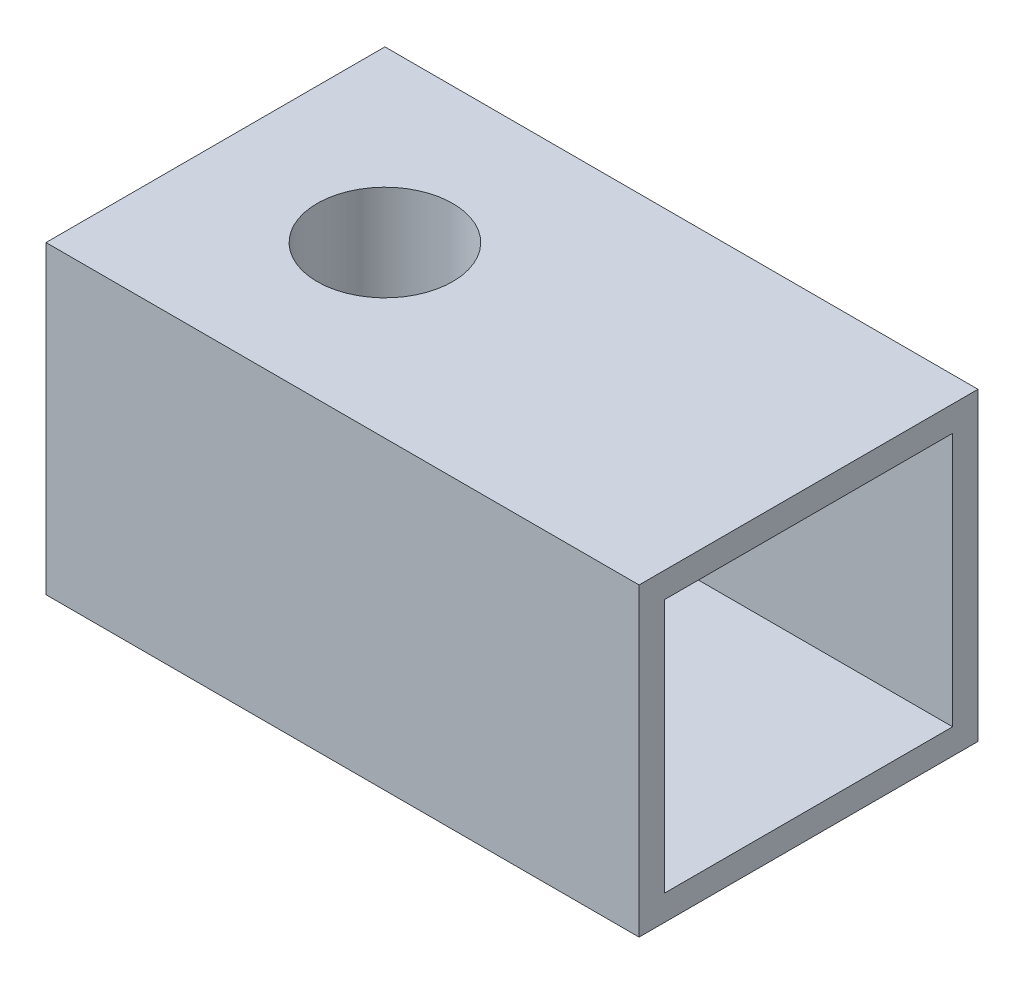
from build123d import *

# Parameters (mm, degrees)
SKETCH1_W           = 35
SKETCH1_H           = 20
SKETCH1_R           = 4
BOSS_EXTRUDE1_DEPTH = 18
SKETCH4_W           = 17
SKETCH4_H           = 15
CUT_EXTRUDE1_DEPTH  = 20
SKETCH5_W           = 5
SKETCH5_H           = 15
CUT_EXTRUDE2_DEPTH  = 3


with BuildPart() as part:
    # Sketch1 → Boss-Extrude1 (new body)
    with BuildSketch(Plane(origin=(0, 0, 0), x_dir=(1, 0, 0), z_dir=(0, 1, 0))):
        Rectangle(SKETCH1_W, SKETCH1_H)
        with Locations(Location((-7.5, 0, 0), (0, 0, 270))):
            Circle(SKETCH1_R, mode=Mode.SUBTRACT)
    extrude(amount=BOSS_EXTRUDE1_DEPTH)

    # Sketch4 → Cut-Extrude1 (cut)
    with BuildSketch(Plane(origin=(17.5, 0, 0), x_dir=(0, 0, -1), z_dir=(1, 0, 0))):
        with Locations((0, 9)):
            Rectangle(SKETCH4_W, SKETCH4_H)
    extrude(amount=-CUT_EXTRUDE1_DEPTH, mode=Mode.SUBTRACT)

    # Sketch5 → Cut-Extrude2 (cut)
    with BuildSketch(Plane.XY.offset(-8.5)):
        with Locations((0, 9)):
            Rectangle(SKETCH5_W, SKETCH5_H)
    extrude(amount=-CUT_EXTRUDE2_DEPTH, mode=Mode.SUBTRACT)


solid = part.part
